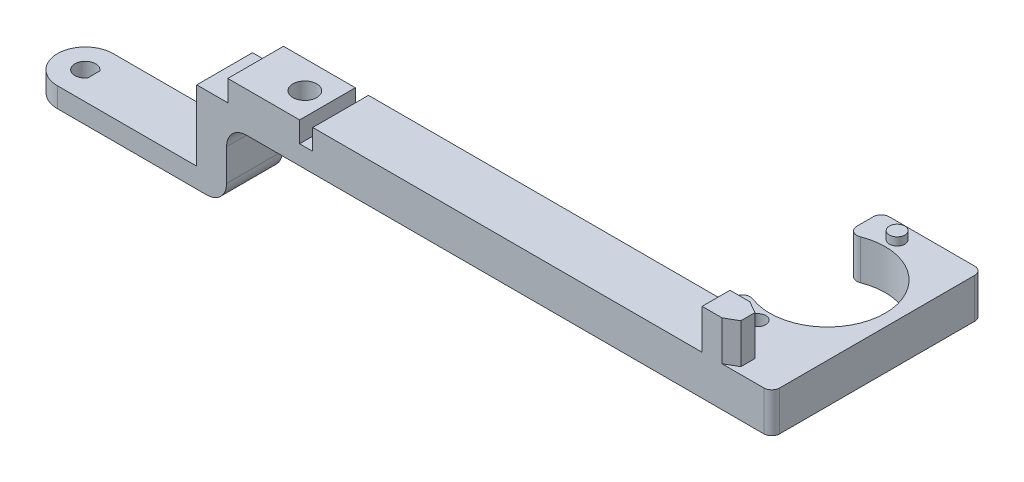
ISO-10303-21;
HEADER;
FILE_DESCRIPTION(('STEP AP214'),'2;1');
FILE_NAME('part.step','',(''),(''),'','','');
FILE_SCHEMA(('AUTOMOTIVE_DESIGN { 1 0 10303 214 1 1 1 1 }'));
ENDSEC;
DATA;
#1=APPLICATION_CONTEXT('core data for automotive mechanical design processes');
#2=APPLICATION_PROTOCOL_DEFINITION('international standard','automotive_design',2000,#1);
#3=PRODUCT_CONTEXT('',#1,'mechanical');
#4=PRODUCT('Part','Part','',(#3));
#5=PRODUCT_RELATED_PRODUCT_CATEGORY('part','',(#4));
#6=PRODUCT_DEFINITION_FORMATION('','',#4);
#7=PRODUCT_DEFINITION_CONTEXT('part definition',#1,'design');
#8=PRODUCT_DEFINITION('design','',#6,#7);
#9=PRODUCT_DEFINITION_SHAPE('','',#8);
#10=(LENGTH_UNIT() NAMED_UNIT(*) SI_UNIT(.MILLI.,.METRE.));
#11=(NAMED_UNIT(*) PLANE_ANGLE_UNIT() SI_UNIT($,.RADIAN.));
#12=(NAMED_UNIT(*) SI_UNIT($,.STERADIAN.) SOLID_ANGLE_UNIT());
#13=UNCERTAINTY_MEASURE_WITH_UNIT(LENGTH_MEASURE(1.E-05),#10,'distance_accuracy_value','');
#14=(GEOMETRIC_REPRESENTATION_CONTEXT(3) GLOBAL_UNCERTAINTY_ASSIGNED_CONTEXT((#13)) GLOBAL_UNIT_ASSIGNED_CONTEXT((#10,
#11,#12)) REPRESENTATION_CONTEXT('',''));
#15=CARTESIAN_POINT('',(0.,0.,0.));
#16=DIRECTION('',(0.,0.,1.));
#17=DIRECTION('',(1.,0.,0.));
#18=AXIS2_PLACEMENT_3D('',#15,#16,#17);
#19=CARTESIAN_POINT('',(186.5,28.,14.));
#20=DIRECTION('',(0.,-1.,0.));
#21=DIRECTION('',(1.,0.,0.));
#22=AXIS2_PLACEMENT_3D('',#19,#20,#21);
#23=PLANE('',#22);
#24=CARTESIAN_POINT('',(169.,28.,-35.));
#25=DIRECTION('',(0.,-1.,0.));
#26=DIRECTION('',(1.,0.,0.));
#27=AXIS2_PLACEMENT_3D('',#24,#25,#26);
#28=CIRCLE('',#27,1.95);
#29=CARTESIAN_POINT('',(170.95,28.,-35.));
#30=VERTEX_POINT('',#29);
#31=EDGE_CURVE('E537',#30,#30,#28,.F.);
#32=ORIENTED_EDGE('',*,*,#31,.F.);
#33=EDGE_LOOP('',(#32));
#34=FACE_BOUND('',#33,.T.);
#35=CARTESIAN_POINT('',(169.,28.,0.));
#36=DIRECTION('',(0.,1.,0.));
#37=DIRECTION('',(-1.,0.,0.));
#38=AXIS2_PLACEMENT_3D('',#35,#36,#37);
#39=CIRCLE('',#38,2.);
#40=CARTESIAN_POINT('',(167.,28.,0.));
#41=VERTEX_POINT('',#40);
#42=EDGE_CURVE('E320',#41,#41,#39,.T.);
#43=ORIENTED_EDGE('',*,*,#42,.F.);
#44=EDGE_LOOP('',(#43));
#45=FACE_BOUND('',#44,.T.);
#46=DIRECTION('',(0.,0.,1.));
#47=VECTOR('',#46,1.);
#48=CARTESIAN_POINT('',(169.,28.,7.));
#49=LINE('',#48,#47);
#50=CARTESIAN_POINT('',(169.,28.,7.));
#51=VERTEX_POINT('',#50);
#52=CARTESIAN_POINT('',(169.,28.,14.));
#53=VERTEX_POINT('',#52);
#54=EDGE_CURVE('E91',#51,#53,#49,.T.);
#55=ORIENTED_EDGE('',*,*,#54,.F.);
#56=DIRECTION('',(-1.,0.,0.));
#57=VECTOR('',#56,1.);
#58=CARTESIAN_POINT('',(174.,28.,7.));
#59=LINE('',#58,#57);
#60=CARTESIAN_POINT('',(174.,28.,7.));
#61=VERTEX_POINT('',#60);
#62=EDGE_CURVE('E95',#61,#51,#59,.T.);
#63=ORIENTED_EDGE('',*,*,#62,.F.);
#64=DIRECTION('',(-0.866025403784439,0.,-0.5));
#65=VECTOR('',#64,1.);
#66=CARTESIAN_POINT('',(177.,28.,8.73205080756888));
#67=LINE('',#66,#65);
#68=CARTESIAN_POINT('',(177.,28.,8.73205080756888));
#69=VERTEX_POINT('',#68);
#70=EDGE_CURVE('E318',#69,#61,#67,.T.);
#71=ORIENTED_EDGE('',*,*,#70,.F.);
#72=DIRECTION('',(0.,0.,-1.));
#73=VECTOR('',#72,1.);
#74=CARTESIAN_POINT('',(177.,28.,12.2679491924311));
#75=LINE('',#74,#73);
#76=CARTESIAN_POINT('',(177.,28.,12.2679491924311));
#77=VERTEX_POINT('',#76);
#78=EDGE_CURVE('E315',#77,#69,#75,.T.);
#79=ORIENTED_EDGE('',*,*,#78,.F.);
#80=DIRECTION('',(0.866025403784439,0.,-0.5));
#81=VECTOR('',#80,1.);
#82=CARTESIAN_POINT('',(174.,28.,14.));
#83=LINE('',#82,#81);
#84=CARTESIAN_POINT('',(174.,28.,14.));
#85=VERTEX_POINT('',#84);
#86=EDGE_CURVE('E669',#85,#77,#83,.T.);
#87=ORIENTED_EDGE('',*,*,#86,.F.);
#88=DIRECTION('',(-1.,0.,0.));
#89=VECTOR('',#88,1.);
#90=CARTESIAN_POINT('',(186.5,28.,14.));
#91=LINE('',#90,#89);
#92=CARTESIAN_POINT('',(184.5,28.,14.));
#93=VERTEX_POINT('',#92);
#94=EDGE_CURVE('E426',#93,#85,#91,.T.);
#95=ORIENTED_EDGE('',*,*,#94,.F.);
#96=CARTESIAN_POINT('',(184.5,28.,12.));
#97=DIRECTION('',(0.,-1.,0.));
#98=DIRECTION('',(1.,0.,0.));
#99=AXIS2_PLACEMENT_3D('',#96,#97,#98);
#100=CIRCLE('',#99,2.);
#101=CARTESIAN_POINT('',(186.5,28.,12.));
#102=VERTEX_POINT('',#101);
#103=EDGE_CURVE('E557',#93,#102,#100,.F.);
#104=ORIENTED_EDGE('',*,*,#103,.T.);
#105=DIRECTION('',(0.,0.,-1.));
#106=VECTOR('',#105,1.);
#107=CARTESIAN_POINT('',(186.5,28.,14.));
#108=LINE('',#107,#106);
#109=CARTESIAN_POINT('',(186.5,28.,-37.));
#110=VERTEX_POINT('',#109);
#111=EDGE_CURVE('E494',#102,#110,#108,.T.);
#112=ORIENTED_EDGE('',*,*,#111,.T.);
#113=CARTESIAN_POINT('',(184.5,28.,-37.));
#114=DIRECTION('',(0.,-1.,0.));
#115=DIRECTION('',(1.,0.,0.));
#116=AXIS2_PLACEMENT_3D('',#113,#114,#115);
#117=CIRCLE('',#116,2.);
#118=CARTESIAN_POINT('',(184.5,28.,-39.));
#119=VERTEX_POINT('',#118);
#120=EDGE_CURVE('E554',#110,#119,#117,.F.);
#121=ORIENTED_EDGE('',*,*,#120,.T.);
#122=DIRECTION('',(-1.,0.,0.));
#123=VECTOR('',#122,1.);
#124=CARTESIAN_POINT('',(186.5,28.,-39.));
#125=LINE('',#124,#123);
#126=CARTESIAN_POINT('',(163.,28.,-39.));
#127=VERTEX_POINT('',#126);
#128=EDGE_CURVE('E338',#119,#127,#125,.T.);
#129=ORIENTED_EDGE('',*,*,#128,.T.);
#130=CARTESIAN_POINT('',(163.,28.,-37.));
#131=DIRECTION('',(0.,-1.,0.));
#132=DIRECTION('',(1.,0.,0.));
#133=AXIS2_PLACEMENT_3D('',#130,#131,#132);
#134=CIRCLE('',#133,2.);
#135=CARTESIAN_POINT('',(161.,28.,-37.));
#136=VERTEX_POINT('',#135);
#137=EDGE_CURVE('E551',#127,#136,#134,.F.);
#138=ORIENTED_EDGE('',*,*,#137,.T.);
#139=DIRECTION('',(0.,0.,1.));
#140=VECTOR('',#139,1.);
#141=CARTESIAN_POINT('',(161.,28.,-39.));
#142=LINE('',#141,#140);
#143=CARTESIAN_POINT('',(161.,28.,-32.8704261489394));
#144=VERTEX_POINT('',#143);
#145=EDGE_CURVE('E360',#136,#144,#142,.T.);
#146=ORIENTED_EDGE('',*,*,#145,.T.);
#147=CARTESIAN_POINT('',(163.,28.,-32.8704261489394));
#148=DIRECTION('',(0.,-1.,0.));
#149=DIRECTION('',(1.,0.,0.));
#150=AXIS2_PLACEMENT_3D('',#147,#148,#149);
#151=CIRCLE('',#150,2.);
#152=CARTESIAN_POINT('',(163.727272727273,28.,-31.0073441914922));
#153=VERTEX_POINT('',#152);
#154=EDGE_CURVE('E545',#144,#153,#151,.F.);
#155=ORIENTED_EDGE('',*,*,#154,.T.);
#156=CARTESIAN_POINT('',(169.,28.,-17.5));
#157=DIRECTION('',(0.,1.,0.));
#158=DIRECTION('',(-1.,0.,0.));
#159=AXIS2_PLACEMENT_3D('',#156,#157,#158);
#160=CIRCLE('',#159,14.5);
#161=CARTESIAN_POINT('',(163.727272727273,28.,-3.9926558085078));
#162=VERTEX_POINT('',#161);
#163=EDGE_CURVE('E364',#162,#153,#160,.T.);
#164=ORIENTED_EDGE('',*,*,#163,.F.);
#165=CARTESIAN_POINT('',(163.,28.,-2.1295738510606));
#166=DIRECTION('',(0.,-1.,0.));
#167=DIRECTION('',(1.,0.,0.));
#168=AXIS2_PLACEMENT_3D('',#165,#166,#167);
#169=CIRCLE('',#168,2.);
#170=CARTESIAN_POINT('',(161.,28.,-2.1295738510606));
#171=VERTEX_POINT('',#170);
#172=EDGE_CURVE('E548',#162,#171,#169,.F.);
#173=ORIENTED_EDGE('',*,*,#172,.T.);
#174=DIRECTION('',(0.,0.,-1.));
#175=VECTOR('',#174,1.);
#176=CARTESIAN_POINT('',(161.,28.,0.));
#177=LINE('',#176,#175);
#178=CARTESIAN_POINT('',(161.,28.,-2.));
#179=VERTEX_POINT('',#178);
#180=EDGE_CURVE('E344',#179,#171,#177,.T.);
#181=ORIENTED_EDGE('',*,*,#180,.F.);
#182=CARTESIAN_POINT('',(159.,28.,-2.));
#183=DIRECTION('',(0.,-1.,0.));
#184=DIRECTION('',(1.,0.,0.));
#185=AXIS2_PLACEMENT_3D('',#182,#183,#184);
#186=CIRCLE('',#185,2.);
#187=CARTESIAN_POINT('',(159.,28.,0.));
#188=VERTEX_POINT('',#187);
#189=EDGE_CURVE('E615',#179,#188,#186,.T.);
#190=ORIENTED_EDGE('',*,*,#189,.T.);
#191=DIRECTION('',(-1.,0.,0.));
#192=VECTOR('',#191,1.);
#193=CARTESIAN_POINT('',(186.5,28.,0.));
#194=LINE('',#193,#192);
#195=CARTESIAN_POINT('',(71.15,28.,0.));
#196=VERTEX_POINT('',#195);
#197=EDGE_CURVE('E468',#188,#196,#194,.T.);
#198=ORIENTED_EDGE('',*,*,#197,.T.);
#199=DIRECTION('',(0.,0.,-1.));
#200=VECTOR('',#199,1.);
#201=CARTESIAN_POINT('',(71.15,28.,14.));
#202=LINE('',#201,#200);
#203=CARTESIAN_POINT('',(71.15,28.,14.));
#204=VERTEX_POINT('',#203);
#205=EDGE_CURVE('E490',#204,#196,#202,.T.);
#206=ORIENTED_EDGE('',*,*,#205,.F.);
#207=EDGE_CURVE('E425',#53,#204,#91,.T.);
#208=ORIENTED_EDGE('',*,*,#207,.F.);
#209=EDGE_LOOP('',(#55,#63,#71,#79,#87,#95,#104,#112,#121,#129,#138,#146,#155,#164,#173,#181,
#190,#198,#206,#208));
#210=FACE_BOUND('',#209,.T.);
#211=ADVANCED_FACE('F75',(#34,#45,#210),#23,.F.);
#212=CARTESIAN_POINT('',(0.,0.,0.));
#213=DIRECTION('',(0.,0.,-1.));
#214=DIRECTION('',(-1.,0.,0.));
#215=AXIS2_PLACEMENT_3D('',#212,#213,#214);
#216=PLANE('',#215);
#217=DIRECTION('',(0.,1.,0.));
#218=VECTOR('',#217,1.);
#219=CARTESIAN_POINT('',(49.5,18.,0.));
#220=LINE('',#219,#218);
#221=CARTESIAN_POINT('',(49.5,5.,0.));
#222=VERTEX_POINT('',#221);
#223=CARTESIAN_POINT('',(49.5,13.,0.));
#224=VERTEX_POINT('',#223);
#225=EDGE_CURVE('E461',#222,#224,#220,.T.);
#226=ORIENTED_EDGE('',*,*,#225,.F.);
#227=CARTESIAN_POINT('',(44.5,5.,0.));
#228=DIRECTION('',(0.,0.,-1.));
#229=DIRECTION('',(-1.,0.,0.));
#230=AXIS2_PLACEMENT_3D('',#227,#228,#229);
#231=CIRCLE('',#230,5.);
#232=CARTESIAN_POINT('',(44.5,0.,0.));
#233=VERTEX_POINT('',#232);
#234=EDGE_CURVE('E628',#222,#233,#231,.T.);
#235=ORIENTED_EDGE('',*,*,#234,.T.);
#236=DIRECTION('',(1.,0.,0.));
#237=VECTOR('',#236,1.);
#238=CARTESIAN_POINT('',(49.5,0.,0.));
#239=LINE('',#238,#237);
#240=CARTESIAN_POINT('',(7.,0.,0.));
#241=VERTEX_POINT('',#240);
#242=EDGE_CURVE('E457',#241,#233,#239,.T.);
#243=ORIENTED_EDGE('',*,*,#242,.F.);
#244=DIRECTION('',(0.,1.,0.));
#245=VECTOR('',#244,1.);
#246=CARTESIAN_POINT('',(7.,-3.,0.));
#247=LINE('',#246,#245);
#248=CARTESIAN_POINT('',(7.,5.,0.));
#249=VERTEX_POINT('',#248);
#250=EDGE_CURVE('E518',#241,#249,#247,.T.);
#251=ORIENTED_EDGE('',*,*,#250,.T.);
#252=DIRECTION('',(-1.,0.,0.));
#253=VECTOR('',#252,1.);
#254=CARTESIAN_POINT('',(0.,5.,0.));
#255=LINE('',#254,#253);
#256=CARTESIAN_POINT('',(42.,5.,0.));
#257=VERTEX_POINT('',#256);
#258=EDGE_CURVE('E453',#257,#249,#255,.T.);
#259=ORIENTED_EDGE('',*,*,#258,.F.);
#260=DIRECTION('',(0.,-1.,0.));
#261=VECTOR('',#260,1.);
#262=CARTESIAN_POINT('',(42.,5.,0.));
#263=LINE('',#262,#261);
#264=CARTESIAN_POINT('',(42.,22.7,0.));
#265=VERTEX_POINT('',#264);
#266=EDGE_CURVE('E450',#265,#257,#263,.T.);
#267=ORIENTED_EDGE('',*,*,#266,.F.);
#268=DIRECTION('',(-1.,0.,0.));
#269=VECTOR('',#268,1.);
#270=CARTESIAN_POINT('',(42.,22.7,0.));
#271=LINE('',#270,#269);
#272=CARTESIAN_POINT('',(49.8,22.7,0.));
#273=VERTEX_POINT('',#272);
#274=EDGE_CURVE('E447',#273,#265,#271,.T.);
#275=ORIENTED_EDGE('',*,*,#274,.F.);
#276=DIRECTION('',(0.,-1.,0.));
#277=VECTOR('',#276,1.);
#278=CARTESIAN_POINT('',(49.8,22.7,0.));
#279=LINE('',#278,#277);
#280=CARTESIAN_POINT('',(49.8,28.,0.));
#281=VERTEX_POINT('',#280);
#282=EDGE_CURVE('E444',#281,#273,#279,.T.);
#283=ORIENTED_EDGE('',*,*,#282,.F.);
#284=DIRECTION('',(-1.,0.,0.));
#285=VECTOR('',#284,1.);
#286=CARTESIAN_POINT('',(67.85,28.,0.));
#287=LINE('',#286,#285);
#288=CARTESIAN_POINT('',(67.85,28.,0.));
#289=VERTEX_POINT('',#288);
#290=EDGE_CURVE('E440',#289,#281,#287,.T.);
#291=ORIENTED_EDGE('',*,*,#290,.F.);
#292=DIRECTION('',(0.,1.,0.));
#293=VECTOR('',#292,1.);
#294=CARTESIAN_POINT('',(67.85,28.,0.));
#295=LINE('',#294,#293);
#296=CARTESIAN_POINT('',(67.85,22.8,0.));
#297=VERTEX_POINT('',#296);
#298=EDGE_CURVE('E401',#297,#289,#295,.T.);
#299=ORIENTED_EDGE('',*,*,#298,.F.);
#300=DIRECTION('',(-1.,0.,0.));
#301=VECTOR('',#300,1.);
#302=CARTESIAN_POINT('',(67.85,22.8,0.));
#303=LINE('',#302,#301);
#304=CARTESIAN_POINT('',(71.15,22.8,0.));
#305=VERTEX_POINT('',#304);
#306=EDGE_CURVE('E474',#305,#297,#303,.T.);
#307=ORIENTED_EDGE('',*,*,#306,.F.);
#308=DIRECTION('',(0.,-1.,0.));
#309=VECTOR('',#308,1.);
#310=CARTESIAN_POINT('',(71.15,22.8,0.));
#311=LINE('',#310,#309);
#312=EDGE_CURVE('E471',#196,#305,#311,.T.);
#313=ORIENTED_EDGE('',*,*,#312,.F.);
#314=ORIENTED_EDGE('',*,*,#197,.F.);
#315=DIRECTION('',(0.,1.,0.));
#316=VECTOR('',#315,1.);
#317=CARTESIAN_POINT('',(159.,0.,0.));
#318=LINE('',#317,#316);
#319=CARTESIAN_POINT('',(159.,18.,0.));
#320=VERTEX_POINT('',#319);
#321=EDGE_CURVE('E604',#188,#320,#318,.F.);
#322=ORIENTED_EDGE('',*,*,#321,.T.);
#323=DIRECTION('',(1.,0.,0.));
#324=VECTOR('',#323,1.);
#325=CARTESIAN_POINT('',(49.5,18.,0.));
#326=LINE('',#325,#324);
#327=CARTESIAN_POINT('',(54.5,18.,0.));
#328=VERTEX_POINT('',#327);
#329=EDGE_CURVE('E465',#328,#320,#326,.T.);
#330=ORIENTED_EDGE('',*,*,#329,.F.);
#331=CARTESIAN_POINT('',(54.5,13.,0.));
#332=DIRECTION('',(0.,0.,-1.));
#333=DIRECTION('',(-1.,0.,0.));
#334=AXIS2_PLACEMENT_3D('',#331,#332,#333);
#335=CIRCLE('',#334,5.);
#336=EDGE_CURVE('E84',#328,#224,#335,.F.);
#337=ORIENTED_EDGE('',*,*,#336,.T.);
#338=EDGE_LOOP('',(#226,#235,#243,#251,#259,#267,#275,#283,#291,#299,#307,#313,#314,#322,#330,#337));
#339=FACE_BOUND('',#338,.T.);
#340=ADVANCED_FACE('F644',(#339),#216,.T.);
#341=CARTESIAN_POINT('',(0.,5.,14.));
#342=DIRECTION('',(0.,-1.,0.));
#343=DIRECTION('',(0.,0.,-1.));
#344=AXIS2_PLACEMENT_3D('',#341,#342,#343);
#345=PLANE('',#344);
#346=CARTESIAN_POINT('',(7.,5.,7.));
#347=DIRECTION('',(0.,1.,0.));
#348=DIRECTION('',(0.,0.,1.));
#349=AXIS2_PLACEMENT_3D('',#346,#347,#348);
#350=CIRCLE('',#349,7.);
#351=CARTESIAN_POINT('',(6.99999999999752,5.,14.));
#352=VERTEX_POINT('',#351);
#353=EDGE_CURVE('E382',#249,#352,#350,.T.);
#354=ORIENTED_EDGE('',*,*,#353,.T.);
#355=DIRECTION('',(-1.,0.,0.));
#356=VECTOR('',#355,1.);
#357=CARTESIAN_POINT('',(0.,5.,14.));
#358=LINE('',#357,#356);
#359=CARTESIAN_POINT('',(42.,5.,14.));
#360=VERTEX_POINT('',#359);
#361=EDGE_CURVE('E410',#360,#352,#358,.T.);
#362=ORIENTED_EDGE('',*,*,#361,.F.);
#363=DIRECTION('',(0.,0.,-1.));
#364=VECTOR('',#363,1.);
#365=CARTESIAN_POINT('',(42.,5.,14.));
#366=LINE('',#365,#364);
#367=EDGE_CURVE('E502',#360,#257,#366,.T.);
#368=ORIENTED_EDGE('',*,*,#367,.T.);
#369=ORIENTED_EDGE('',*,*,#258,.T.);
#370=EDGE_LOOP('',(#354,#362,#368,#369));
#371=FACE_BOUND('',#370,.T.);
#372=DIRECTION('',(0.,0.,1.));
#373=VECTOR('',#372,1.);
#374=CARTESIAN_POINT('',(9.1,5.,0.));
#375=LINE('',#374,#373);
#376=CARTESIAN_POINT('',(9.1,5.,5.46702902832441));
#377=VERTEX_POINT('',#376);
#378=CARTESIAN_POINT('',(9.1,5.,8.53297097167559));
#379=VERTEX_POINT('',#378);
#380=EDGE_CURVE('E356',#377,#379,#375,.T.);
#381=ORIENTED_EDGE('',*,*,#380,.T.);
#382=CARTESIAN_POINT('',(7.,5.,7.));
#383=DIRECTION('',(0.,1.,0.));
#384=DIRECTION('',(0.,0.,1.));
#385=AXIS2_PLACEMENT_3D('',#382,#383,#384);
#386=CIRCLE('',#385,2.6);
#387=EDGE_CURVE('E374',#377,#379,#386,.T.);
#388=ORIENTED_EDGE('',*,*,#387,.F.);
#389=EDGE_LOOP('',(#381,#388));
#390=FACE_BOUND('',#389,.T.);
#391=ADVANCED_FACE('F730',(#371,#390),#345,.F.);
#392=CARTESIAN_POINT('',(49.5,0.,14.));
#393=DIRECTION('',(0.,1.,0.));
#394=DIRECTION('',(-1.,0.,0.));
#395=AXIS2_PLACEMENT_3D('',#392,#393,#394);
#396=PLANE('',#395);
#397=ORIENTED_EDGE('',*,*,#242,.T.);
#398=DIRECTION('',(0.,0.,-1.));
#399=VECTOR('',#398,1.);
#400=CARTESIAN_POINT('',(44.5,0.,14.));
#401=LINE('',#400,#399);
#402=CARTESIAN_POINT('',(44.5,0.,14.));
#403=VERTEX_POINT('',#402);
#404=EDGE_CURVE('E631',#233,#403,#401,.F.);
#405=ORIENTED_EDGE('',*,*,#404,.T.);
#406=DIRECTION('',(1.,0.,0.));
#407=VECTOR('',#406,1.);
#408=CARTESIAN_POINT('',(49.5,0.,14.));
#409=LINE('',#408,#407);
#410=CARTESIAN_POINT('',(6.99999999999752,0.,14.));
#411=VERTEX_POINT('',#410);
#412=EDGE_CURVE('E414',#411,#403,#409,.T.);
#413=ORIENTED_EDGE('',*,*,#412,.F.);
#414=CARTESIAN_POINT('',(7.,0.,7.));
#415=DIRECTION('',(0.,1.,0.));
#416=DIRECTION('',(-1.,0.,0.));
#417=AXIS2_PLACEMENT_3D('',#414,#415,#416);
#418=CIRCLE('',#417,7.);
#419=EDGE_CURVE('E388',#241,#411,#418,.T.);
#420=ORIENTED_EDGE('',*,*,#419,.F.);
#421=EDGE_LOOP('',(#397,#405,#413,#420));
#422=FACE_BOUND('',#421,.T.);
#423=DIRECTION('',(0.,0.,1.));
#424=VECTOR('',#423,1.);
#425=CARTESIAN_POINT('',(9.1,0.,14.));
#426=LINE('',#425,#424);
#427=CARTESIAN_POINT('',(9.1,0.,5.46702902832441));
#428=VERTEX_POINT('',#427);
#429=CARTESIAN_POINT('',(9.1,0.,8.53297097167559));
#430=VERTEX_POINT('',#429);
#431=EDGE_CURVE('E533',#428,#430,#426,.T.);
#432=ORIENTED_EDGE('',*,*,#431,.F.);
#433=CARTESIAN_POINT('',(7.,0.,7.));
#434=DIRECTION('',(0.,1.,0.));
#435=DIRECTION('',(-1.,0.,0.));
#436=AXIS2_PLACEMENT_3D('',#433,#434,#435);
#437=CIRCLE('',#436,2.6);
#438=EDGE_CURVE('E529',#428,#430,#437,.T.);
#439=ORIENTED_EDGE('',*,*,#438,.T.);
#440=EDGE_LOOP('',(#432,#439));
#441=FACE_BOUND('',#440,.T.);
#442=ADVANCED_FACE('F748',(#422,#441),#396,.F.);
#443=CARTESIAN_POINT('',(0.,0.,14.));
#444=DIRECTION('',(0.,0.,-1.));
#445=DIRECTION('',(-1.,0.,0.));
#446=AXIS2_PLACEMENT_3D('',#443,#444,#445);
#447=PLANE('',#446);
#448=ORIENTED_EDGE('',*,*,#412,.T.);
#449=CARTESIAN_POINT('',(44.5,5.,14.));
#450=DIRECTION('',(0.,0.,-1.));
#451=DIRECTION('',(-1.,0.,0.));
#452=AXIS2_PLACEMENT_3D('',#449,#450,#451);
#453=CIRCLE('',#452,5.);
#454=CARTESIAN_POINT('',(49.5,5.,14.));
#455=VERTEX_POINT('',#454);
#456=EDGE_CURVE('E634',#403,#455,#453,.F.);
#457=ORIENTED_EDGE('',*,*,#456,.T.);
#458=DIRECTION('',(0.,1.,0.));
#459=VECTOR('',#458,1.);
#460=CARTESIAN_POINT('',(49.5,18.,14.));
#461=LINE('',#460,#459);
#462=CARTESIAN_POINT('',(49.5,13.,14.));
#463=VERTEX_POINT('',#462);
#464=EDGE_CURVE('E418',#455,#463,#461,.T.);
#465=ORIENTED_EDGE('',*,*,#464,.T.);
#466=CARTESIAN_POINT('',(54.5,13.,14.));
#467=DIRECTION('',(0.,0.,-1.));
#468=DIRECTION('',(-1.,0.,0.));
#469=AXIS2_PLACEMENT_3D('',#466,#467,#468);
#470=CIRCLE('',#469,5.);
#471=CARTESIAN_POINT('',(54.5,18.,14.));
#472=VERTEX_POINT('',#471);
#473=EDGE_CURVE('E12',#463,#472,#470,.T.);
#474=ORIENTED_EDGE('',*,*,#473,.T.);
#475=DIRECTION('',(1.,0.,0.));
#476=VECTOR('',#475,1.);
#477=CARTESIAN_POINT('',(49.5,18.,14.));
#478=LINE('',#477,#476);
#479=CARTESIAN_POINT('',(184.5,18.,14.));
#480=VERTEX_POINT('',#479);
#481=EDGE_CURVE('E422',#472,#480,#478,.T.);
#482=ORIENTED_EDGE('',*,*,#481,.T.);
#483=DIRECTION('',(0.,1.,0.));
#484=VECTOR('',#483,1.);
#485=CARTESIAN_POINT('',(184.5,0.,14.));
#486=LINE('',#485,#484);
#487=EDGE_CURVE('E541',#480,#93,#486,.T.);
#488=ORIENTED_EDGE('',*,*,#487,.T.);
#489=ORIENTED_EDGE('',*,*,#94,.T.);
#490=DIRECTION('',(0.,-1.,0.));
#491=VECTOR('',#490,1.);
#492=CARTESIAN_POINT('',(174.,38.,14.));
#493=LINE('',#492,#491);
#494=CARTESIAN_POINT('',(174.,38.,14.));
#495=VERTEX_POINT('',#494);
#496=EDGE_CURVE('E688',#495,#85,#493,.T.);
#497=ORIENTED_EDGE('',*,*,#496,.F.);
#498=DIRECTION('',(1.,0.,0.));
#499=VECTOR('',#498,1.);
#500=CARTESIAN_POINT('',(169.,38.,14.));
#501=LINE('',#500,#499);
#502=CARTESIAN_POINT('',(169.,38.,14.));
#503=VERTEX_POINT('',#502);
#504=EDGE_CURVE('E695',#503,#495,#501,.T.);
#505=ORIENTED_EDGE('',*,*,#504,.F.);
#506=DIRECTION('',(0.,-1.,0.));
#507=VECTOR('',#506,1.);
#508=CARTESIAN_POINT('',(169.,38.,14.));
#509=LINE('',#508,#507);
#510=EDGE_CURVE('E327',#503,#53,#509,.T.);
#511=ORIENTED_EDGE('',*,*,#510,.T.);
#512=ORIENTED_EDGE('',*,*,#207,.T.);
#513=DIRECTION('',(0.,-1.,0.));
#514=VECTOR('',#513,1.);
#515=CARTESIAN_POINT('',(71.15,22.8,14.));
#516=LINE('',#515,#514);
#517=CARTESIAN_POINT('',(71.15,22.8,14.));
#518=VERTEX_POINT('',#517);
#519=EDGE_CURVE('E430',#204,#518,#516,.T.);
#520=ORIENTED_EDGE('',*,*,#519,.T.);
#521=DIRECTION('',(-1.,0.,0.));
#522=VECTOR('',#521,1.);
#523=CARTESIAN_POINT('',(67.85,22.8,14.));
#524=LINE('',#523,#522);
#525=CARTESIAN_POINT('',(67.85,22.8,14.));
#526=VERTEX_POINT('',#525);
#527=EDGE_CURVE('E433',#518,#526,#524,.T.);
#528=ORIENTED_EDGE('',*,*,#527,.T.);
#529=DIRECTION('',(0.,1.,0.));
#530=VECTOR('',#529,1.);
#531=CARTESIAN_POINT('',(67.85,28.,14.));
#532=LINE('',#531,#530);
#533=CARTESIAN_POINT('',(67.85,28.,14.));
#534=VERTEX_POINT('',#533);
#535=EDGE_CURVE('E436',#526,#534,#532,.T.);
#536=ORIENTED_EDGE('',*,*,#535,.T.);
#537=DIRECTION('',(-1.,0.,0.));
#538=VECTOR('',#537,1.);
#539=CARTESIAN_POINT('',(67.85,28.,14.));
#540=LINE('',#539,#538);
#541=CARTESIAN_POINT('',(49.8,28.,14.));
#542=VERTEX_POINT('',#541);
#543=EDGE_CURVE('E396',#534,#542,#540,.T.);
#544=ORIENTED_EDGE('',*,*,#543,.T.);
#545=DIRECTION('',(0.,-1.,0.));
#546=VECTOR('',#545,1.);
#547=CARTESIAN_POINT('',(49.8,22.7,14.));
#548=LINE('',#547,#546);
#549=CARTESIAN_POINT('',(49.8,22.7,14.));
#550=VERTEX_POINT('',#549);
#551=EDGE_CURVE('E400',#542,#550,#548,.T.);
#552=ORIENTED_EDGE('',*,*,#551,.T.);
#553=DIRECTION('',(-1.,0.,0.));
#554=VECTOR('',#553,1.);
#555=CARTESIAN_POINT('',(42.,22.7,14.));
#556=LINE('',#555,#554);
#557=CARTESIAN_POINT('',(42.,22.7,14.));
#558=VERTEX_POINT('',#557);
#559=EDGE_CURVE('E404',#550,#558,#556,.T.);
#560=ORIENTED_EDGE('',*,*,#559,.T.);
#561=DIRECTION('',(0.,-1.,0.));
#562=VECTOR('',#561,1.);
#563=CARTESIAN_POINT('',(42.,5.,14.));
#564=LINE('',#563,#562);
#565=EDGE_CURVE('E407',#558,#360,#564,.T.);
#566=ORIENTED_EDGE('',*,*,#565,.T.);
#567=ORIENTED_EDGE('',*,*,#361,.T.);
#568=DIRECTION('',(0.,1.,0.));
#569=VECTOR('',#568,1.);
#570=CARTESIAN_POINT('',(7.,-3.,14.));
#571=LINE('',#570,#569);
#572=EDGE_CURVE('E525',#411,#352,#571,.T.);
#573=ORIENTED_EDGE('',*,*,#572,.F.);
#574=EDGE_LOOP('',(#448,#457,#465,#474,#482,#488,#489,#497,#505,#511,#512,#520,#528,#536,#544,
#552,#560,#566,#567,#573));
#575=FACE_BOUND('',#574,.T.);
#576=ADVANCED_FACE('F655',(#575),#447,.F.);
#577=CARTESIAN_POINT('',(67.85,28.,14.));
#578=DIRECTION('',(0.,-1.,0.));
#579=DIRECTION('',(1.,0.,0.));
#580=AXIS2_PLACEMENT_3D('',#577,#578,#579);
#581=PLANE('',#580);
#582=CARTESIAN_POINT('',(62.15,28.,7.));
#583=DIRECTION('',(0.,1.,0.));
#584=DIRECTION('',(0.,0.,1.));
#585=AXIS2_PLACEMENT_3D('',#582,#583,#584);
#586=CIRCLE('',#585,3.00000000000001);
#587=CARTESIAN_POINT('',(62.15,28.,10.));
#588=VERTEX_POINT('',#587);
#589=EDGE_CURVE('E391',#588,#588,#586,.T.);
#590=ORIENTED_EDGE('',*,*,#589,.F.);
#591=EDGE_LOOP('',(#590));
#592=FACE_BOUND('',#591,.T.);
#593=ORIENTED_EDGE('',*,*,#290,.T.);
#594=DIRECTION('',(0.,0.,-1.));
#595=VECTOR('',#594,1.);
#596=CARTESIAN_POINT('',(49.8,28.,14.));
#597=LINE('',#596,#595);
#598=EDGE_CURVE('E514',#542,#281,#597,.T.);
#599=ORIENTED_EDGE('',*,*,#598,.F.);
#600=ORIENTED_EDGE('',*,*,#543,.F.);
#601=DIRECTION('',(0.,0.,-1.));
#602=VECTOR('',#601,1.);
#603=CARTESIAN_POINT('',(67.85,28.,14.));
#604=LINE('',#603,#602);
#605=EDGE_CURVE('E439',#534,#289,#604,.T.);
#606=ORIENTED_EDGE('',*,*,#605,.T.);
#607=EDGE_LOOP('',(#593,#599,#600,#606));
#608=FACE_BOUND('',#607,.T.);
#609=ADVANCED_FACE('F765',(#592,#608),#581,.F.);
#610=CARTESIAN_POINT('',(49.8,22.7,14.));
#611=DIRECTION('',(1.,0.,0.));
#612=DIRECTION('',(0.,0.,-1.));
#613=AXIS2_PLACEMENT_3D('',#610,#611,#612);
#614=PLANE('',#613);
#615=ORIENTED_EDGE('',*,*,#282,.T.);
#616=DIRECTION('',(0.,0.,-1.));
#617=VECTOR('',#616,1.);
#618=CARTESIAN_POINT('',(49.8,22.7,14.));
#619=LINE('',#618,#617);
#620=EDGE_CURVE('E510',#550,#273,#619,.T.);
#621=ORIENTED_EDGE('',*,*,#620,.F.);
#622=ORIENTED_EDGE('',*,*,#551,.F.);
#623=ORIENTED_EDGE('',*,*,#598,.T.);
#624=EDGE_LOOP('',(#615,#621,#622,#623));
#625=FACE_BOUND('',#624,.T.);
#626=ADVANCED_FACE('F761',(#625),#614,.F.);
#627=CARTESIAN_POINT('',(42.,22.7,14.));
#628=DIRECTION('',(0.,-1.,0.));
#629=DIRECTION('',(0.,0.,-1.));
#630=AXIS2_PLACEMENT_3D('',#627,#628,#629);
#631=PLANE('',#630);
#632=ORIENTED_EDGE('',*,*,#274,.T.);
#633=DIRECTION('',(0.,0.,-1.));
#634=VECTOR('',#633,1.);
#635=CARTESIAN_POINT('',(42.,22.7,14.));
#636=LINE('',#635,#634);
#637=EDGE_CURVE('E506',#558,#265,#636,.T.);
#638=ORIENTED_EDGE('',*,*,#637,.F.);
#639=ORIENTED_EDGE('',*,*,#559,.F.);
#640=ORIENTED_EDGE('',*,*,#620,.T.);
#641=EDGE_LOOP('',(#632,#638,#639,#640));
#642=FACE_BOUND('',#641,.T.);
#643=ADVANCED_FACE('F757',(#642),#631,.F.);
#644=CARTESIAN_POINT('',(42.,5.,14.));
#645=DIRECTION('',(1.,0.,0.));
#646=DIRECTION('',(0.,0.,-1.));
#647=AXIS2_PLACEMENT_3D('',#644,#645,#646);
#648=PLANE('',#647);
#649=ORIENTED_EDGE('',*,*,#266,.T.);
#650=ORIENTED_EDGE('',*,*,#367,.F.);
#651=ORIENTED_EDGE('',*,*,#565,.F.);
#652=ORIENTED_EDGE('',*,*,#637,.T.);
#653=EDGE_LOOP('',(#649,#650,#651,#652));
#654=FACE_BOUND('',#653,.T.);
#655=ADVANCED_FACE('F747',(#654),#648,.F.);
#656=CARTESIAN_POINT('',(49.5,18.,14.));
#657=DIRECTION('',(-1.,0.,0.));
#658=DIRECTION('',(0.,0.,1.));
#659=AXIS2_PLACEMENT_3D('',#656,#657,#658);
#660=PLANE('',#659);
#661=ORIENTED_EDGE('',*,*,#464,.F.);
#662=DIRECTION('',(0.,0.,-1.));
#663=VECTOR('',#662,1.);
#664=CARTESIAN_POINT('',(49.5,5.,14.));
#665=LINE('',#664,#663);
#666=EDGE_CURVE('E624',#455,#222,#665,.T.);
#667=ORIENTED_EDGE('',*,*,#666,.T.);
#668=ORIENTED_EDGE('',*,*,#225,.T.);
#669=DIRECTION('',(0.,0.,-1.));
#670=VECTOR('',#669,1.);
#671=CARTESIAN_POINT('',(49.5,13.,14.));
#672=LINE('',#671,#670);
#673=EDGE_CURVE('E621',#224,#463,#672,.F.);
#674=ORIENTED_EDGE('',*,*,#673,.T.);
#675=EDGE_LOOP('',(#661,#667,#668,#674));
#676=FACE_BOUND('',#675,.T.);
#677=ADVANCED_FACE('F650',(#676),#660,.F.);
#678=CARTESIAN_POINT('',(49.5,18.,14.));
#679=DIRECTION('',(0.,1.,0.));
#680=DIRECTION('',(0.,0.,1.));
#681=AXIS2_PLACEMENT_3D('',#678,#679,#680);
#682=PLANE('',#681);
#683=CARTESIAN_POINT('',(169.,18.,0.));
#684=DIRECTION('',(0.,1.,0.));
#685=DIRECTION('',(0.,0.,1.));
#686=AXIS2_PLACEMENT_3D('',#683,#684,#685);
#687=CIRCLE('',#686,2.);
#688=CARTESIAN_POINT('',(169.,18.,2.));
#689=VERTEX_POINT('',#688);
#690=EDGE_CURVE('E325',#689,#689,#687,.T.);
#691=ORIENTED_EDGE('',*,*,#690,.T.);
#692=EDGE_LOOP('',(#691));
#693=FACE_BOUND('',#692,.T.);
#694=CARTESIAN_POINT('',(62.15,18.,7.));
#695=DIRECTION('',(0.,1.,0.));
#696=DIRECTION('',(0.,0.,1.));
#697=AXIS2_PLACEMENT_3D('',#694,#695,#696);
#698=CIRCLE('',#697,3.00000000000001);
#699=CARTESIAN_POINT('',(62.15,18.,10.));
#700=VERTEX_POINT('',#699);
#701=EDGE_CURVE('E395',#700,#700,#698,.T.);
#702=ORIENTED_EDGE('',*,*,#701,.T.);
#703=EDGE_LOOP('',(#702));
#704=FACE_BOUND('',#703,.T.);
#705=ORIENTED_EDGE('',*,*,#481,.F.);
#706=DIRECTION('',(0.,0.,-1.));
#707=VECTOR('',#706,1.);
#708=CARTESIAN_POINT('',(54.5,18.,0.));
#709=LINE('',#708,#707);
#710=EDGE_CURVE('E637',#472,#328,#709,.T.);
#711=ORIENTED_EDGE('',*,*,#710,.T.);
#712=ORIENTED_EDGE('',*,*,#329,.T.);
#713=CARTESIAN_POINT('',(159.,18.,-2.));
#714=DIRECTION('',(0.,1.,0.));
#715=DIRECTION('',(0.,0.,1.));
#716=AXIS2_PLACEMENT_3D('',#713,#714,#715);
#717=CIRCLE('',#716,2.);
#718=CARTESIAN_POINT('',(161.,18.,-2.));
#719=VERTEX_POINT('',#718);
#720=EDGE_CURVE('E618',#320,#719,#717,.T.);
#721=ORIENTED_EDGE('',*,*,#720,.T.);
#722=DIRECTION('',(0.,0.,-1.));
#723=VECTOR('',#722,1.);
#724=CARTESIAN_POINT('',(161.,18.,0.));
#725=LINE('',#724,#723);
#726=CARTESIAN_POINT('',(161.,18.,-2.1295738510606));
#727=VERTEX_POINT('',#726);
#728=EDGE_CURVE('E352',#719,#727,#725,.T.);
#729=ORIENTED_EDGE('',*,*,#728,.T.);
#730=CARTESIAN_POINT('',(163.,18.,-2.1295738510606));
#731=DIRECTION('',(0.,1.,0.));
#732=DIRECTION('',(0.,0.,1.));
#733=AXIS2_PLACEMENT_3D('',#730,#731,#732);
#734=CIRCLE('',#733,2.);
#735=CARTESIAN_POINT('',(163.727272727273,18.,-3.9926558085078));
#736=VERTEX_POINT('',#735);
#737=EDGE_CURVE('E570',#727,#736,#734,.F.);
#738=ORIENTED_EDGE('',*,*,#737,.T.);
#739=CARTESIAN_POINT('',(169.,18.,-17.5));
#740=DIRECTION('',(0.,1.,0.));
#741=DIRECTION('',(-1.,0.,0.));
#742=AXIS2_PLACEMENT_3D('',#739,#740,#741);
#743=CIRCLE('',#742,14.5);
#744=CARTESIAN_POINT('',(163.727272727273,18.,-31.0073441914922));
#745=VERTEX_POINT('',#744);
#746=EDGE_CURVE('E348',#736,#745,#743,.T.);
#747=ORIENTED_EDGE('',*,*,#746,.T.);
#748=CARTESIAN_POINT('',(163.,18.,-32.8704261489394));
#749=DIRECTION('',(0.,1.,0.));
#750=DIRECTION('',(0.,0.,1.));
#751=AXIS2_PLACEMENT_3D('',#748,#749,#750);
#752=CIRCLE('',#751,2.);
#753=CARTESIAN_POINT('',(161.,18.,-32.8704261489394));
#754=VERTEX_POINT('',#753);
#755=EDGE_CURVE('E567',#745,#754,#752,.F.);
#756=ORIENTED_EDGE('',*,*,#755,.T.);
#757=DIRECTION('',(0.,0.,1.));
#758=VECTOR('',#757,1.);
#759=CARTESIAN_POINT('',(161.,18.,-39.));
#760=LINE('',#759,#758);
#761=CARTESIAN_POINT('',(161.,18.,-37.));
#762=VERTEX_POINT('',#761);
#763=EDGE_CURVE('E343',#762,#754,#760,.T.);
#764=ORIENTED_EDGE('',*,*,#763,.F.);
#765=CARTESIAN_POINT('',(163.,18.,-37.));
#766=DIRECTION('',(0.,1.,0.));
#767=DIRECTION('',(0.,0.,1.));
#768=AXIS2_PLACEMENT_3D('',#765,#766,#767);
#769=CIRCLE('',#768,2.);
#770=CARTESIAN_POINT('',(163.,18.,-39.));
#771=VERTEX_POINT('',#770);
#772=EDGE_CURVE('E573',#762,#771,#769,.F.);
#773=ORIENTED_EDGE('',*,*,#772,.T.);
#774=DIRECTION('',(-1.,0.,0.));
#775=VECTOR('',#774,1.);
#776=CARTESIAN_POINT('',(186.5,18.,-39.));
#777=LINE('',#776,#775);
#778=CARTESIAN_POINT('',(184.5,18.,-39.));
#779=VERTEX_POINT('',#778);
#780=EDGE_CURVE('E339',#779,#771,#777,.T.);
#781=ORIENTED_EDGE('',*,*,#780,.F.);
#782=CARTESIAN_POINT('',(184.5,18.,-37.));
#783=DIRECTION('',(0.,1.,0.));
#784=DIRECTION('',(0.,0.,1.));
#785=AXIS2_PLACEMENT_3D('',#782,#783,#784);
#786=CIRCLE('',#785,2.);
#787=CARTESIAN_POINT('',(186.5,18.,-37.));
#788=VERTEX_POINT('',#787);
#789=EDGE_CURVE('E576',#779,#788,#786,.F.);
#790=ORIENTED_EDGE('',*,*,#789,.T.);
#791=DIRECTION('',(0.,0.,-1.));
#792=VECTOR('',#791,1.);
#793=CARTESIAN_POINT('',(186.5,18.,14.));
#794=LINE('',#793,#792);
#795=CARTESIAN_POINT('',(186.5,18.,12.));
#796=VERTEX_POINT('',#795);
#797=EDGE_CURVE('E498',#796,#788,#794,.T.);
#798=ORIENTED_EDGE('',*,*,#797,.F.);
#799=CARTESIAN_POINT('',(184.5,18.,12.));
#800=DIRECTION('',(0.,1.,0.));
#801=DIRECTION('',(0.,0.,1.));
#802=AXIS2_PLACEMENT_3D('',#799,#800,#801);
#803=CIRCLE('',#802,2.);
#804=EDGE_CURVE('E579',#796,#480,#803,.F.);
#805=ORIENTED_EDGE('',*,*,#804,.T.);
#806=EDGE_LOOP('',(#705,#711,#712,#721,#729,#738,#747,#756,#764,#773,#781,#790,#798,#805));
#807=FACE_BOUND('',#806,.T.);
#808=ADVANCED_FACE('F657',(#693,#704,#807),#682,.F.);
#809=CARTESIAN_POINT('',(186.5,18.,14.));
#810=DIRECTION('',(-1.,0.,0.));
#811=DIRECTION('',(0.,0.,1.));
#812=AXIS2_PLACEMENT_3D('',#809,#810,#811);
#813=PLANE('',#812);
#814=ORIENTED_EDGE('',*,*,#111,.F.);
#815=DIRECTION('',(0.,1.,0.));
#816=VECTOR('',#815,1.);
#817=CARTESIAN_POINT('',(186.5,18.,12.));
#818=LINE('',#817,#816);
#819=EDGE_CURVE('E564',#102,#796,#818,.F.);
#820=ORIENTED_EDGE('',*,*,#819,.T.);
#821=ORIENTED_EDGE('',*,*,#797,.T.);
#822=DIRECTION('',(0.,1.,0.));
#823=VECTOR('',#822,1.);
#824=CARTESIAN_POINT('',(186.5,28.,-37.));
#825=LINE('',#824,#823);
#826=EDGE_CURVE('E560',#788,#110,#825,.T.);
#827=ORIENTED_EDGE('',*,*,#826,.T.);
#828=EDGE_LOOP('',(#814,#820,#821,#827));
#829=FACE_BOUND('',#828,.T.);
#830=ADVANCED_FACE('F738',(#829),#813,.F.);
#831=CARTESIAN_POINT('',(71.15,22.8,14.));
#832=DIRECTION('',(1.,0.,0.));
#833=DIRECTION('',(0.,0.,-1.));
#834=AXIS2_PLACEMENT_3D('',#831,#832,#833);
#835=PLANE('',#834);
#836=ORIENTED_EDGE('',*,*,#312,.T.);
#837=DIRECTION('',(0.,0.,-1.));
#838=VECTOR('',#837,1.);
#839=CARTESIAN_POINT('',(71.15,22.8,14.));
#840=LINE('',#839,#838);
#841=EDGE_CURVE('E486',#518,#305,#840,.T.);
#842=ORIENTED_EDGE('',*,*,#841,.F.);
#843=ORIENTED_EDGE('',*,*,#519,.F.);
#844=ORIENTED_EDGE('',*,*,#205,.T.);
#845=EDGE_LOOP('',(#836,#842,#843,#844));
#846=FACE_BOUND('',#845,.T.);
#847=ADVANCED_FACE('F736',(#846),#835,.F.);
#848=CARTESIAN_POINT('',(67.85,22.8,14.));
#849=DIRECTION('',(0.,-1.,0.));
#850=DIRECTION('',(0.,0.,-1.));
#851=AXIS2_PLACEMENT_3D('',#848,#849,#850);
#852=PLANE('',#851);
#853=ORIENTED_EDGE('',*,*,#306,.T.);
#854=DIRECTION('',(0.,0.,-1.));
#855=VECTOR('',#854,1.);
#856=CARTESIAN_POINT('',(67.85,22.8,14.));
#857=LINE('',#856,#855);
#858=EDGE_CURVE('E482',#526,#297,#857,.T.);
#859=ORIENTED_EDGE('',*,*,#858,.F.);
#860=ORIENTED_EDGE('',*,*,#527,.F.);
#861=ORIENTED_EDGE('',*,*,#841,.T.);
#862=EDGE_LOOP('',(#853,#859,#860,#861));
#863=FACE_BOUND('',#862,.T.);
#864=ADVANCED_FACE('F829',(#863),#852,.F.);
#865=CARTESIAN_POINT('',(67.85,28.,14.));
#866=DIRECTION('',(-1.,0.,0.));
#867=DIRECTION('',(0.,0.,1.));
#868=AXIS2_PLACEMENT_3D('',#865,#866,#867);
#869=PLANE('',#868);
#870=ORIENTED_EDGE('',*,*,#298,.T.);
#871=ORIENTED_EDGE('',*,*,#605,.F.);
#872=ORIENTED_EDGE('',*,*,#535,.F.);
#873=ORIENTED_EDGE('',*,*,#858,.T.);
#874=EDGE_LOOP('',(#870,#871,#872,#873));
#875=FACE_BOUND('',#874,.T.);
#876=ADVANCED_FACE('F824',(#875),#869,.F.);
#877=CARTESIAN_POINT('',(62.15,6.99999999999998,7.));
#878=DIRECTION('',(0.,1.,0.));
#879=DIRECTION('',(0.,0.,1.));
#880=AXIS2_PLACEMENT_3D('',#877,#878,#879);
#881=CYLINDRICAL_SURFACE('',#880,3.00000000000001);
#882=ORIENTED_EDGE('',*,*,#589,.T.);
#883=EDGE_LOOP('',(#882));
#884=FACE_BOUND('',#883,.T.);
#885=ORIENTED_EDGE('',*,*,#701,.F.);
#886=EDGE_LOOP('',(#885));
#887=FACE_BOUND('',#886,.T.);
#888=ADVANCED_FACE('F889',(#884,#887),#881,.F.);
#889=CARTESIAN_POINT('',(7.,-3.,7.));
#890=DIRECTION('',(0.,1.,0.));
#891=DIRECTION('',(0.,0.,1.));
#892=AXIS2_PLACEMENT_3D('',#889,#890,#891);
#893=CYLINDRICAL_SURFACE('',#892,7.);
#894=ORIENTED_EDGE('',*,*,#419,.T.);
#895=ORIENTED_EDGE('',*,*,#572,.T.);
#896=ORIENTED_EDGE('',*,*,#353,.F.);
#897=ORIENTED_EDGE('',*,*,#250,.F.);
#898=EDGE_LOOP('',(#894,#895,#896,#897));
#899=FACE_BOUND('',#898,.T.);
#900=ADVANCED_FACE('F885',(#899),#893,.T.);
#901=CARTESIAN_POINT('',(9.1,-3.,0.));
#902=DIRECTION('',(-1.,0.,0.));
#903=DIRECTION('',(0.,0.,1.));
#904=AXIS2_PLACEMENT_3D('',#901,#902,#903);
#905=PLANE('',#904);
#906=ORIENTED_EDGE('',*,*,#431,.T.);
#907=DIRECTION('',(0.,1.,0.));
#908=VECTOR('',#907,1.);
#909=CARTESIAN_POINT('',(9.1,-3.,8.53297097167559));
#910=LINE('',#909,#908);
#911=EDGE_CURVE('E379',#430,#379,#910,.T.);
#912=ORIENTED_EDGE('',*,*,#911,.T.);
#913=ORIENTED_EDGE('',*,*,#380,.F.);
#914=DIRECTION('',(0.,1.,0.));
#915=VECTOR('',#914,1.);
#916=CARTESIAN_POINT('',(9.1,-3.,5.46702902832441));
#917=LINE('',#916,#915);
#918=EDGE_CURVE('E378',#428,#377,#917,.T.);
#919=ORIENTED_EDGE('',*,*,#918,.F.);
#920=EDGE_LOOP('',(#906,#912,#913,#919));
#921=FACE_BOUND('',#920,.T.);
#922=ADVANCED_FACE('F881',(#921),#905,.T.);
#923=CARTESIAN_POINT('',(7.,-3.,7.));
#924=DIRECTION('',(0.,1.,0.));
#925=DIRECTION('',(0.,0.,1.));
#926=AXIS2_PLACEMENT_3D('',#923,#924,#925);
#927=CYLINDRICAL_SURFACE('',#926,2.6);
#928=ORIENTED_EDGE('',*,*,#918,.T.);
#929=ORIENTED_EDGE('',*,*,#387,.T.);
#930=ORIENTED_EDGE('',*,*,#911,.F.);
#931=ORIENTED_EDGE('',*,*,#438,.F.);
#932=EDGE_LOOP('',(#928,#929,#930,#931));
#933=FACE_BOUND('',#932,.T.);
#934=ADVANCED_FACE('F878',(#933),#927,.F.);
#935=CARTESIAN_POINT('',(161.,18.,0.));
#936=DIRECTION('',(1.,0.,0.));
#937=DIRECTION('',(0.,1.,0.));
#938=AXIS2_PLACEMENT_3D('',#935,#936,#937);
#939=PLANE('',#938);
#940=ORIENTED_EDGE('',*,*,#728,.F.);
#941=DIRECTION('',(0.,1.,0.));
#942=VECTOR('',#941,1.);
#943=CARTESIAN_POINT('',(161.,18.,-2.));
#944=LINE('',#943,#942);
#945=EDGE_CURVE('E600',#719,#179,#944,.T.);
#946=ORIENTED_EDGE('',*,*,#945,.T.);
#947=ORIENTED_EDGE('',*,*,#180,.T.);
#948=DIRECTION('',(0.,1.,0.));
#949=VECTOR('',#948,1.);
#950=CARTESIAN_POINT('',(161.,18.,-2.1295738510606));
#951=LINE('',#950,#949);
#952=EDGE_CURVE('E597',#171,#727,#951,.F.);
#953=ORIENTED_EDGE('',*,*,#952,.T.);
#954=EDGE_LOOP('',(#940,#946,#947,#953));
#955=FACE_BOUND('',#954,.T.);
#956=ADVANCED_FACE('F840',(#955),#939,.F.);
#957=CARTESIAN_POINT('',(169.,18.,-17.5));
#958=DIRECTION('',(0.,1.,0.));
#959=DIRECTION('',(-1.,0.,0.));
#960=AXIS2_PLACEMENT_3D('',#957,#958,#959);
#961=CYLINDRICAL_SURFACE('',#960,14.5);
#962=ORIENTED_EDGE('',*,*,#746,.F.);
#963=DIRECTION('',(0.,1.,0.));
#964=VECTOR('',#963,1.);
#965=CARTESIAN_POINT('',(163.727272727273,18.,-3.9926558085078));
#966=LINE('',#965,#964);
#967=EDGE_CURVE('E611',#736,#162,#966,.T.);
#968=ORIENTED_EDGE('',*,*,#967,.T.);
#969=ORIENTED_EDGE('',*,*,#163,.T.);
#970=DIRECTION('',(0.,1.,0.));
#971=VECTOR('',#970,1.);
#972=CARTESIAN_POINT('',(163.727272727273,18.,-31.0073441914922));
#973=LINE('',#972,#971);
#974=EDGE_CURVE('E608',#153,#745,#973,.F.);
#975=ORIENTED_EDGE('',*,*,#974,.T.);
#976=EDGE_LOOP('',(#962,#968,#969,#975));
#977=FACE_BOUND('',#976,.T.);
#978=ADVANCED_FACE('F847',(#977),#961,.F.);
#979=CARTESIAN_POINT('',(161.,18.,-39.));
#980=DIRECTION('',(-1.,0.,0.));
#981=DIRECTION('',(0.,-1.,0.));
#982=AXIS2_PLACEMENT_3D('',#979,#980,#981);
#983=PLANE('',#982);
#984=ORIENTED_EDGE('',*,*,#145,.F.);
#985=DIRECTION('',(0.,1.,0.));
#986=VECTOR('',#985,1.);
#987=CARTESIAN_POINT('',(161.,18.,-37.));
#988=LINE('',#987,#986);
#989=EDGE_CURVE('E594',#136,#762,#988,.F.);
#990=ORIENTED_EDGE('',*,*,#989,.T.);
#991=ORIENTED_EDGE('',*,*,#763,.T.);
#992=DIRECTION('',(0.,-1.,0.));
#993=VECTOR('',#992,1.);
#994=CARTESIAN_POINT('',(161.,28.,-32.8704261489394));
#995=LINE('',#994,#993);
#996=EDGE_CURVE('E590',#754,#144,#995,.F.);
#997=ORIENTED_EDGE('',*,*,#996,.T.);
#998=EDGE_LOOP('',(#984,#990,#991,#997));
#999=FACE_BOUND('',#998,.T.);
#1000=ADVANCED_FACE('F855',(#999),#983,.T.);
#1001=CARTESIAN_POINT('',(186.5,18.,-39.));
#1002=DIRECTION('',(0.,0.,-1.));
#1003=DIRECTION('',(-1.,0.,0.));
#1004=AXIS2_PLACEMENT_3D('',#1001,#1002,#1003);
#1005=PLANE('',#1004);
#1006=ORIENTED_EDGE('',*,*,#128,.F.);
#1007=DIRECTION('',(0.,1.,0.));
#1008=VECTOR('',#1007,1.);
#1009=CARTESIAN_POINT('',(184.5,18.,-39.));
#1010=LINE('',#1009,#1008);
#1011=EDGE_CURVE('E587',#119,#779,#1010,.F.);
#1012=ORIENTED_EDGE('',*,*,#1011,.T.);
#1013=ORIENTED_EDGE('',*,*,#780,.T.);
#1014=DIRECTION('',(0.,1.,0.));
#1015=VECTOR('',#1014,1.);
#1016=CARTESIAN_POINT('',(163.,18.,-39.));
#1017=LINE('',#1016,#1015);
#1018=EDGE_CURVE('E583',#771,#127,#1017,.T.);
#1019=ORIENTED_EDGE('',*,*,#1018,.T.);
#1020=EDGE_LOOP('',(#1006,#1012,#1013,#1019));
#1021=FACE_BOUND('',#1020,.T.);
#1022=ADVANCED_FACE('F862',(#1021),#1005,.T.);
#1023=CARTESIAN_POINT('',(169.,30.,-35.));
#1024=DIRECTION('',(0.,-1.,0.));
#1025=DIRECTION('',(1.,0.,0.));
#1026=AXIS2_PLACEMENT_3D('',#1023,#1024,#1025);
#1027=CYLINDRICAL_SURFACE('',#1026,1.95);
#1028=CARTESIAN_POINT('',(169.,30.,-35.));
#1029=DIRECTION('',(0.,1.,0.));
#1030=DIRECTION('',(-1.,0.,0.));
#1031=AXIS2_PLACEMENT_3D('',#1028,#1029,#1030);
#1032=CIRCLE('',#1031,1.95);
#1033=CARTESIAN_POINT('',(167.05,30.,-35.));
#1034=VERTEX_POINT('',#1033);
#1035=EDGE_CURVE('E334',#1034,#1034,#1032,.T.);
#1036=ORIENTED_EDGE('',*,*,#1035,.F.);
#1037=EDGE_LOOP('',(#1036));
#1038=FACE_BOUND('',#1037,.T.);
#1039=ORIENTED_EDGE('',*,*,#31,.T.);
#1040=EDGE_LOOP('',(#1039));
#1041=FACE_BOUND('',#1040,.T.);
#1042=ADVANCED_FACE('F866',(#1038,#1041),#1027,.T.);
#1043=CARTESIAN_POINT('',(169.,30.,-35.));
#1044=DIRECTION('',(0.,1.,0.));
#1045=DIRECTION('',(-1.,0.,0.));
#1046=AXIS2_PLACEMENT_3D('',#1043,#1044,#1045);
#1047=PLANE('',#1046);
#1048=ORIENTED_EDGE('',*,*,#1035,.T.);
#1049=EDGE_LOOP('',(#1048));
#1050=FACE_BOUND('',#1049,.T.);
#1051=ADVANCED_FACE('F872',(#1050),#1047,.T.);
#1052=CARTESIAN_POINT('',(169.,-4.,0.));
#1053=DIRECTION('',(0.,1.,0.));
#1054=DIRECTION('',(-1.,0.,0.));
#1055=AXIS2_PLACEMENT_3D('',#1052,#1053,#1054);
#1056=CYLINDRICAL_SURFACE('',#1055,2.);
#1057=ORIENTED_EDGE('',*,*,#42,.T.);
#1058=EDGE_LOOP('',(#1057));
#1059=FACE_BOUND('',#1058,.T.);
#1060=ORIENTED_EDGE('',*,*,#690,.F.);
#1061=EDGE_LOOP('',(#1060));
#1062=FACE_BOUND('',#1061,.T.);
#1063=ADVANCED_FACE('F773',(#1059,#1062),#1056,.F.);
#1064=CARTESIAN_POINT('',(184.5,0.,12.));
#1065=DIRECTION('',(0.,1.,0.));
#1066=DIRECTION('',(0.,0.,1.));
#1067=AXIS2_PLACEMENT_3D('',#1064,#1065,#1066);
#1068=CYLINDRICAL_SURFACE('',#1067,2.);
#1069=ORIENTED_EDGE('',*,*,#804,.F.);
#1070=ORIENTED_EDGE('',*,*,#819,.F.);
#1071=ORIENTED_EDGE('',*,*,#103,.F.);
#1072=ORIENTED_EDGE('',*,*,#487,.F.);
#1073=EDGE_LOOP('',(#1069,#1070,#1071,#1072));
#1074=FACE_BOUND('',#1073,.T.);
#1075=ADVANCED_FACE('F663',(#1074),#1068,.T.);
#1076=CARTESIAN_POINT('',(184.5,18.,-37.));
#1077=DIRECTION('',(0.,-1.,0.));
#1078=DIRECTION('',(0.,0.,-1.));
#1079=AXIS2_PLACEMENT_3D('',#1076,#1077,#1078);
#1080=CYLINDRICAL_SURFACE('',#1079,2.);
#1081=ORIENTED_EDGE('',*,*,#789,.F.);
#1082=ORIENTED_EDGE('',*,*,#1011,.F.);
#1083=ORIENTED_EDGE('',*,*,#120,.F.);
#1084=ORIENTED_EDGE('',*,*,#826,.F.);
#1085=EDGE_LOOP('',(#1081,#1082,#1083,#1084));
#1086=FACE_BOUND('',#1085,.T.);
#1087=ADVANCED_FACE('F772',(#1086),#1080,.T.);
#1088=CARTESIAN_POINT('',(163.,18.,-37.));
#1089=DIRECTION('',(0.,1.,0.));
#1090=DIRECTION('',(-1.,0.,0.));
#1091=AXIS2_PLACEMENT_3D('',#1088,#1089,#1090);
#1092=CYLINDRICAL_SURFACE('',#1091,2.);
#1093=ORIENTED_EDGE('',*,*,#772,.F.);
#1094=ORIENTED_EDGE('',*,*,#989,.F.);
#1095=ORIENTED_EDGE('',*,*,#137,.F.);
#1096=ORIENTED_EDGE('',*,*,#1018,.F.);
#1097=EDGE_LOOP('',(#1093,#1094,#1095,#1096));
#1098=FACE_BOUND('',#1097,.T.);
#1099=ADVANCED_FACE('F776',(#1098),#1092,.T.);
#1100=CARTESIAN_POINT('',(159.,18.,-2.));
#1101=DIRECTION('',(0.,1.,0.));
#1102=DIRECTION('',(-1.,0.,0.));
#1103=AXIS2_PLACEMENT_3D('',#1100,#1101,#1102);
#1104=CYLINDRICAL_SURFACE('',#1103,2.);
#1105=ORIENTED_EDGE('',*,*,#720,.F.);
#1106=ORIENTED_EDGE('',*,*,#321,.F.);
#1107=ORIENTED_EDGE('',*,*,#189,.F.);
#1108=ORIENTED_EDGE('',*,*,#945,.F.);
#1109=EDGE_LOOP('',(#1105,#1106,#1107,#1108));
#1110=FACE_BOUND('',#1109,.T.);
#1111=ADVANCED_FACE('F780',(#1110),#1104,.F.);
#1112=CARTESIAN_POINT('',(163.,18.,-2.1295738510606));
#1113=DIRECTION('',(0.,1.,0.));
#1114=DIRECTION('',(-1.,0.,0.));
#1115=AXIS2_PLACEMENT_3D('',#1112,#1113,#1114);
#1116=CYLINDRICAL_SURFACE('',#1115,2.);
#1117=ORIENTED_EDGE('',*,*,#737,.F.);
#1118=ORIENTED_EDGE('',*,*,#952,.F.);
#1119=ORIENTED_EDGE('',*,*,#172,.F.);
#1120=ORIENTED_EDGE('',*,*,#967,.F.);
#1121=EDGE_LOOP('',(#1117,#1118,#1119,#1120));
#1122=FACE_BOUND('',#1121,.T.);
#1123=ADVANCED_FACE('F784',(#1122),#1116,.T.);
#1124=CARTESIAN_POINT('',(163.,18.,-32.8704261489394));
#1125=DIRECTION('',(0.,1.,0.));
#1126=DIRECTION('',(-1.,0.,0.));
#1127=AXIS2_PLACEMENT_3D('',#1124,#1125,#1126);
#1128=CYLINDRICAL_SURFACE('',#1127,2.);
#1129=ORIENTED_EDGE('',*,*,#755,.F.);
#1130=ORIENTED_EDGE('',*,*,#974,.F.);
#1131=ORIENTED_EDGE('',*,*,#154,.F.);
#1132=ORIENTED_EDGE('',*,*,#996,.F.);
#1133=EDGE_LOOP('',(#1129,#1130,#1131,#1132));
#1134=FACE_BOUND('',#1133,.T.);
#1135=ADVANCED_FACE('F788',(#1134),#1128,.T.);
#1136=CARTESIAN_POINT('',(44.5,5.,14.));
#1137=DIRECTION('',(0.,0.,-1.));
#1138=DIRECTION('',(-1.,0.,0.));
#1139=AXIS2_PLACEMENT_3D('',#1136,#1137,#1138);
#1140=CYLINDRICAL_SURFACE('',#1139,5.);
#1141=ORIENTED_EDGE('',*,*,#456,.F.);
#1142=ORIENTED_EDGE('',*,*,#404,.F.);
#1143=ORIENTED_EDGE('',*,*,#234,.F.);
#1144=ORIENTED_EDGE('',*,*,#666,.F.);
#1145=EDGE_LOOP('',(#1141,#1142,#1143,#1144));
#1146=FACE_BOUND('',#1145,.T.);
#1147=ADVANCED_FACE('F791',(#1146),#1140,.T.);
#1148=CARTESIAN_POINT('',(54.5,13.,14.));
#1149=DIRECTION('',(0.,0.,1.));
#1150=DIRECTION('',(1.,0.,0.));
#1151=AXIS2_PLACEMENT_3D('',#1148,#1149,#1150);
#1152=CYLINDRICAL_SURFACE('',#1151,5.);
#1153=ORIENTED_EDGE('',*,*,#473,.F.);
#1154=ORIENTED_EDGE('',*,*,#673,.F.);
#1155=ORIENTED_EDGE('',*,*,#336,.F.);
#1156=ORIENTED_EDGE('',*,*,#710,.F.);
#1157=EDGE_LOOP('',(#1153,#1154,#1155,#1156));
#1158=FACE_BOUND('',#1157,.T.);
#1159=ADVANCED_FACE('F77',(#1158),#1152,.F.);
#1160=CARTESIAN_POINT('',(177.,38.,8.73205080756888));
#1161=DIRECTION('',(-0.5,0.,0.866025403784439));
#1162=DIRECTION('',(0.866025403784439,0.,0.5));
#1163=AXIS2_PLACEMENT_3D('',#1160,#1161,#1162);
#1164=PLANE('',#1163);
#1165=ORIENTED_EDGE('',*,*,#70,.T.);
#1166=DIRECTION('',(0.,-1.,0.));
#1167=VECTOR('',#1166,1.);
#1168=CARTESIAN_POINT('',(174.,38.,7.));
#1169=LINE('',#1168,#1167);
#1170=CARTESIAN_POINT('',(174.,38.,7.));
#1171=VERTEX_POINT('',#1170);
#1172=EDGE_CURVE('E297',#1171,#61,#1169,.T.);
#1173=ORIENTED_EDGE('',*,*,#1172,.F.);
#1174=DIRECTION('',(-0.866025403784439,0.,-0.5));
#1175=VECTOR('',#1174,1.);
#1176=CARTESIAN_POINT('',(177.,38.,8.73205080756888));
#1177=LINE('',#1176,#1175);
#1178=CARTESIAN_POINT('',(177.,38.,8.73205080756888));
#1179=VERTEX_POINT('',#1178);
#1180=EDGE_CURVE('E305',#1179,#1171,#1177,.T.);
#1181=ORIENTED_EDGE('',*,*,#1180,.F.);
#1182=DIRECTION('',(0.,-1.,0.));
#1183=VECTOR('',#1182,1.);
#1184=CARTESIAN_POINT('',(177.,38.,8.73205080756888));
#1185=LINE('',#1184,#1183);
#1186=EDGE_CURVE('E682',#1179,#69,#1185,.T.);
#1187=ORIENTED_EDGE('',*,*,#1186,.T.);
#1188=EDGE_LOOP('',(#1165,#1173,#1181,#1187));
#1189=FACE_BOUND('',#1188,.T.);
#1190=ADVANCED_FACE('F317',(#1189),#1164,.F.);
#1191=CARTESIAN_POINT('',(174.,38.,7.));
#1192=DIRECTION('',(0.,0.,1.));
#1193=DIRECTION('',(1.,0.,0.));
#1194=AXIS2_PLACEMENT_3D('',#1191,#1192,#1193);
#1195=PLANE('',#1194);
#1196=ORIENTED_EDGE('',*,*,#62,.T.);
#1197=DIRECTION('',(0.,-1.,0.));
#1198=VECTOR('',#1197,1.);
#1199=CARTESIAN_POINT('',(169.,38.,7.));
#1200=LINE('',#1199,#1198);
#1201=CARTESIAN_POINT('',(169.,38.,7.));
#1202=VERTEX_POINT('',#1201);
#1203=EDGE_CURVE('E300',#1202,#51,#1200,.T.);
#1204=ORIENTED_EDGE('',*,*,#1203,.F.);
#1205=DIRECTION('',(-1.,0.,0.));
#1206=VECTOR('',#1205,1.);
#1207=CARTESIAN_POINT('',(174.,38.,7.));
#1208=LINE('',#1207,#1206);
#1209=EDGE_CURVE('E293',#1171,#1202,#1208,.T.);
#1210=ORIENTED_EDGE('',*,*,#1209,.F.);
#1211=ORIENTED_EDGE('',*,*,#1172,.T.);
#1212=EDGE_LOOP('',(#1196,#1204,#1210,#1211));
#1213=FACE_BOUND('',#1212,.T.);
#1214=ADVANCED_FACE('F295',(#1213),#1195,.F.);
#1215=CARTESIAN_POINT('',(169.,38.,7.));
#1216=DIRECTION('',(1.,0.,0.));
#1217=DIRECTION('',(0.,1.,0.));
#1218=AXIS2_PLACEMENT_3D('',#1215,#1216,#1217);
#1219=PLANE('',#1218);
#1220=ORIENTED_EDGE('',*,*,#54,.T.);
#1221=ORIENTED_EDGE('',*,*,#510,.F.);
#1222=DIRECTION('',(0.,0.,1.));
#1223=VECTOR('',#1222,1.);
#1224=CARTESIAN_POINT('',(169.,38.,7.));
#1225=LINE('',#1224,#1223);
#1226=EDGE_CURVE('E304',#1202,#503,#1225,.T.);
#1227=ORIENTED_EDGE('',*,*,#1226,.F.);
#1228=ORIENTED_EDGE('',*,*,#1203,.T.);
#1229=EDGE_LOOP('',(#1220,#1221,#1227,#1228));
#1230=FACE_BOUND('',#1229,.T.);
#1231=ADVANCED_FACE('F697',(#1230),#1219,.F.);
#1232=CARTESIAN_POINT('',(174.,38.,14.));
#1233=DIRECTION('',(-0.5,0.,-0.866025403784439));
#1234=DIRECTION('',(-0.866025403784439,0.,0.5));
#1235=AXIS2_PLACEMENT_3D('',#1232,#1233,#1234);
#1236=PLANE('',#1235);
#1237=ORIENTED_EDGE('',*,*,#86,.T.);
#1238=DIRECTION('',(0.,-1.,0.));
#1239=VECTOR('',#1238,1.);
#1240=CARTESIAN_POINT('',(177.,38.,12.2679491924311));
#1241=LINE('',#1240,#1239);
#1242=CARTESIAN_POINT('',(177.,38.,12.2679491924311));
#1243=VERTEX_POINT('',#1242);
#1244=EDGE_CURVE('E685',#1243,#77,#1241,.T.);
#1245=ORIENTED_EDGE('',*,*,#1244,.F.);
#1246=DIRECTION('',(0.866025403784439,0.,-0.5));
#1247=VECTOR('',#1246,1.);
#1248=CARTESIAN_POINT('',(174.,38.,14.));
#1249=LINE('',#1248,#1247);
#1250=EDGE_CURVE('E701',#495,#1243,#1249,.T.);
#1251=ORIENTED_EDGE('',*,*,#1250,.F.);
#1252=ORIENTED_EDGE('',*,*,#496,.T.);
#1253=EDGE_LOOP('',(#1237,#1245,#1251,#1252));
#1254=FACE_BOUND('',#1253,.T.);
#1255=ADVANCED_FACE('F711',(#1254),#1236,.F.);
#1256=CARTESIAN_POINT('',(177.,38.,12.2679491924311));
#1257=DIRECTION('',(-1.,0.,0.));
#1258=DIRECTION('',(0.,-1.,0.));
#1259=AXIS2_PLACEMENT_3D('',#1256,#1257,#1258);
#1260=PLANE('',#1259);
#1261=ORIENTED_EDGE('',*,*,#78,.T.);
#1262=ORIENTED_EDGE('',*,*,#1186,.F.);
#1263=DIRECTION('',(0.,0.,-1.));
#1264=VECTOR('',#1263,1.);
#1265=CARTESIAN_POINT('',(177.,38.,12.2679491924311));
#1266=LINE('',#1265,#1264);
#1267=EDGE_CURVE('E310',#1243,#1179,#1266,.T.);
#1268=ORIENTED_EDGE('',*,*,#1267,.F.);
#1269=ORIENTED_EDGE('',*,*,#1244,.T.);
#1270=EDGE_LOOP('',(#1261,#1262,#1268,#1269));
#1271=FACE_BOUND('',#1270,.T.);
#1272=ADVANCED_FACE('F713',(#1271),#1260,.F.);
#1273=CARTESIAN_POINT('',(0.,38.,0.));
#1274=DIRECTION('',(0.,1.,0.));
#1275=DIRECTION('',(0.,0.,1.));
#1276=AXIS2_PLACEMENT_3D('',#1273,#1274,#1275);
#1277=PLANE('',#1276);
#1278=ORIENTED_EDGE('',*,*,#1180,.T.);
#1279=ORIENTED_EDGE('',*,*,#1209,.T.);
#1280=ORIENTED_EDGE('',*,*,#1226,.T.);
#1281=ORIENTED_EDGE('',*,*,#504,.T.);
#1282=ORIENTED_EDGE('',*,*,#1250,.T.);
#1283=ORIENTED_EDGE('',*,*,#1267,.T.);
#1284=EDGE_LOOP('',(#1278,#1279,#1280,#1281,#1282,#1283));
#1285=FACE_BOUND('',#1284,.T.);
#1286=ADVANCED_FACE('F308',(#1285),#1277,.T.);
#1287=CLOSED_SHELL('',(#211,#340,#391,#442,#576,#609,#626,#643,#655,#677,#808,#830,#847,#864,
#876,#888,#900,#922,#934,#956,#978,#1000,#1022,#1042,#1051,#1063,#1075,#1087,#1099,#1111,#1123,
#1135,#1147,#1159,#1190,#1214,#1231,#1255,#1272,#1286));
#1288=MANIFOLD_SOLID_BREP('B2',#1287);
#1289=ADVANCED_BREP_SHAPE_REPRESENTATION('',(#18,#1288),#14);
#1290=SHAPE_DEFINITION_REPRESENTATION(#9,#1289);
ENDSEC;
END-ISO-10303-21;
